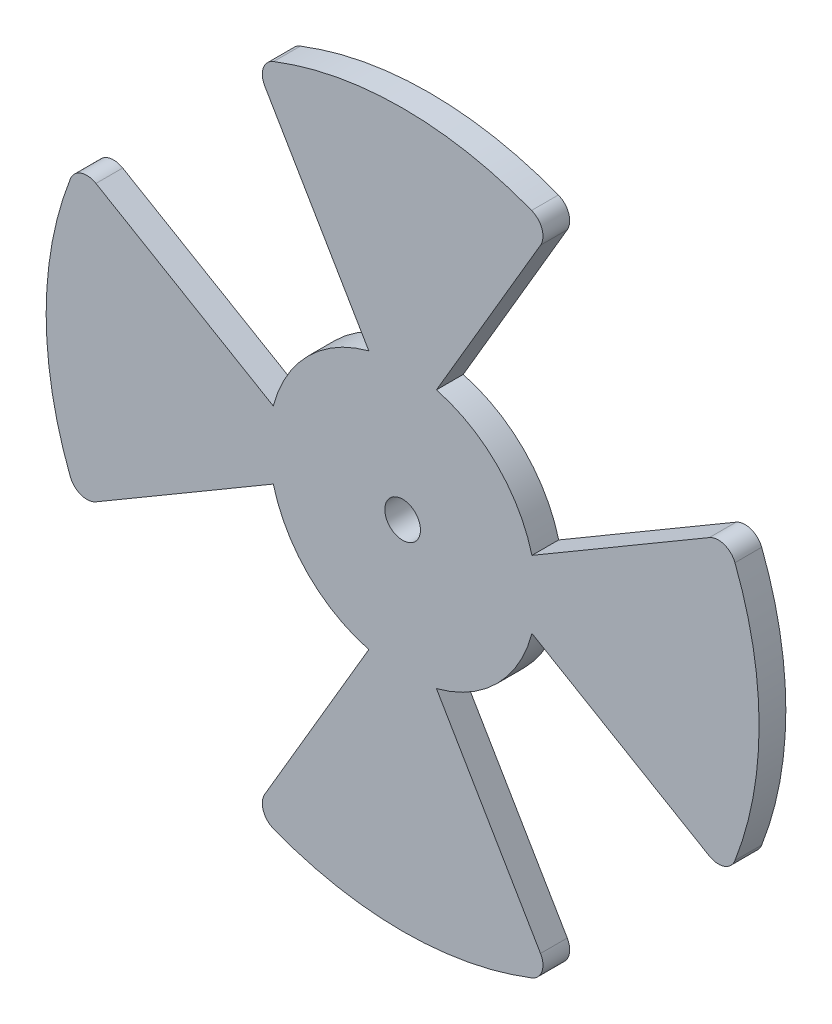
from build123d import *

# Parameters (mm, degrees)
SKETCH1_R      = 2
EXTRUDE1_DEPTH = 3


with BuildPart() as part:
    # Sketch1 → Extrude1 (new body)
    with BuildSketch(Plane.XY):
        with BuildLine():
            Line((15.47221798, 34.413900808), (3.793328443, 14.5124312))
            ThreePointArc((3.793328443, 14.5124312), (10.606601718, 10.606601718), (14.5124312, 3.793328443))
            Line((14.5124312, 3.793328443), (34.413900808, 15.47221798))
            ThreePointArc((34.413900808, 15.47221798), (36.083634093, 15.636133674), (37.29068076, 14.470837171))
            ThreePointArc((37.29068076, 14.470837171), (40, 0), (37.29068076, -14.470837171))
            ThreePointArc((37.29068076, -14.470837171), (36.083634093, -15.636133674), (34.413900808, -15.47221798))
            Line((34.413900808, -15.47221798), (14.5124312, -3.793328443))
            ThreePointArc((14.5124312, -3.793328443), (10.606601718, -10.606601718), (3.793328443, -14.5124312))
            Line((3.793328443, -14.5124312), (15.47221798, -34.413900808))
            ThreePointArc((15.47221798, -34.413900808), (15.636133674, -36.083634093), (14.470837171, -37.29068076))
            ThreePointArc((14.470837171, -37.29068076), (0, -40), (-14.470837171, -37.29068076))
            ThreePointArc((-14.470837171, -37.29068076), (-15.636133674, -36.083634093), (-15.47221798, -34.413900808))
            Line((-15.47221798, -34.413900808), (-3.793328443, -14.5124312))
            ThreePointArc((-3.793328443, -14.5124312), (-10.606601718, -10.606601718), (-14.5124312, -3.793328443))
            Line((-14.5124312, -3.793328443), (-34.413900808, -15.47221798))
            ThreePointArc((-34.413900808, -15.47221798), (-36.083634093, -15.636133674), (-37.29068076, -14.470837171))
            ThreePointArc((-37.29068076, -14.470837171), (-40, 0), (-37.29068076, 14.470837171))
            ThreePointArc((-37.29068076, 14.470837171), (-36.083634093, 15.636133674), (-34.413900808, 15.47221798))
            Line((-34.413900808, 15.47221798), (-14.5124312, 3.793328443))
            ThreePointArc((-14.5124312, 3.793328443), (-10.606601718, 10.606601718), (-3.793328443, 14.5124312))
            Line((-3.793328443, 14.5124312), (-15.47221798, 34.413900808))
            ThreePointArc((-15.47221798, 34.413900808), (-15.636133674, 36.083634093), (-14.470837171, 37.29068076))
            ThreePointArc((-14.470837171, 37.29068076), (0, 40), (14.470837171, 37.29068076))
            ThreePointArc((14.470837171, 37.29068076), (15.636133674, 36.083634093), (15.47221798, 34.413900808))
        make_face()
        Circle(SKETCH1_R, mode=Mode.SUBTRACT)
    extrude(amount=EXTRUDE1_DEPTH)


solid = part.part
